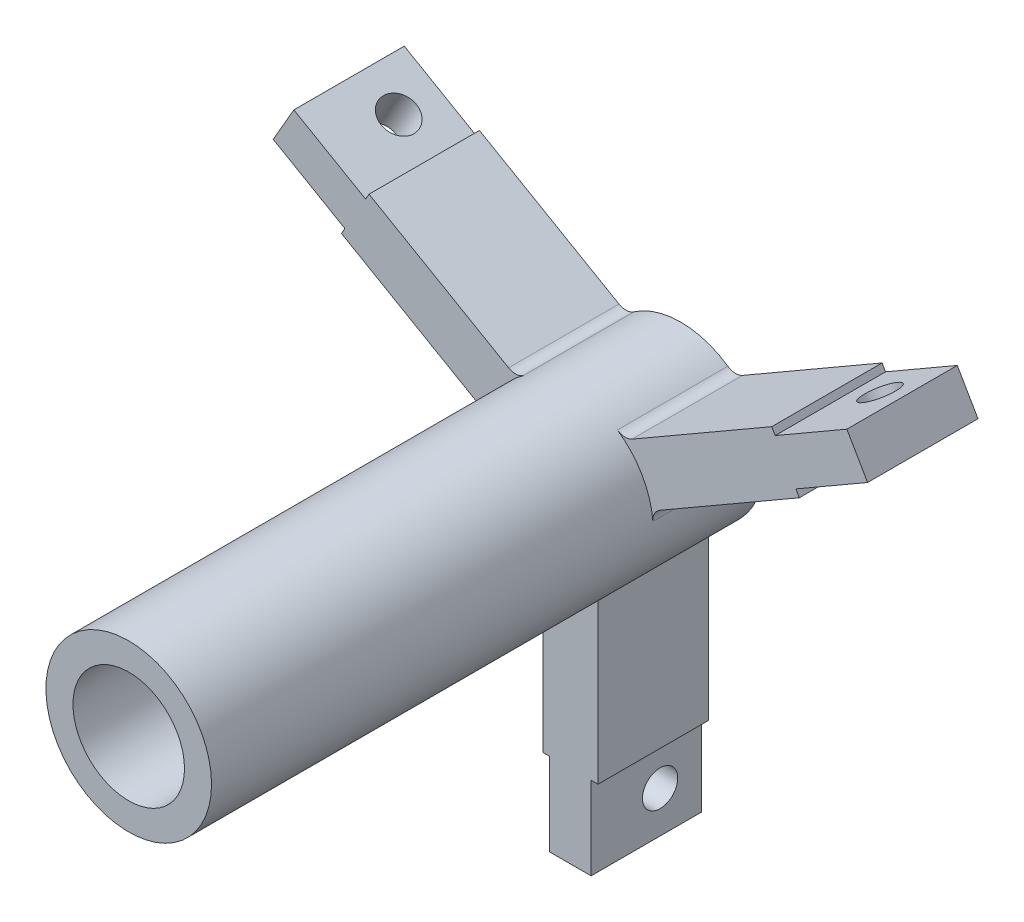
from build123d import *

# Parameters (mm, degrees)
SKETCH1_R                = 19.05
SKETCH1_R_2              = 12.827
BASE_EXTRUDE_DEPTH       = 127
BOSS_EXTRUDE1_REACH      = 161.889
BOSS_EXTRUDE1_END_RADIUS = 19.05
SKETCH2_W                = 9.525
SKETCH2_H                = 25.4
SKETCH3_R                = 4.064
CUT_EXTRUDE1_DEPTH       = 151.008250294
CIRPATTERN1_COUNT        = 3
SKETCH6_R                = 4.064
CUT_EXTRUDE2_DEPTH       = 168.917059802
SKETCH7_R                = 4.064
CUT_EXTRUDE3_DEPTH       = 158.267243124
SKETCH10_R               = 7.1501
CUT_EXTRUDE4_DEPTH       = 0.635
BOSS_EXTRUDE3_REACH      = 177.154
BOSS_EXTRUDE3_END_RADIUS = 19.05
SKETCH13_W               = 12.7
SKETCH13_H               = 25.4
CIRPATTERN2_COUNT        = 3
FILLET1_R                = 3.175
FILLET2_R                = 3.175
FILLET3_R                = 3.175


with BuildPart() as part:
    # Sketch1 → Base-Extrude (new body)
    with BuildSketch(Plane.XY):
        Circle(SKETCH1_R)
        Circle(SKETCH1_R_2, mode=Mode.SUBTRACT)
    extrude(amount=BASE_EXTRUDE_DEPTH)

    # Boss-Extrude1: up to this cylinder (the profile starts outside it)
    boss_extrude1_end = Plane(origin=(0, 0, 12.7), z_dir=(0, 0, -1)) * Cylinder(BOSS_EXTRUDE1_END_RADIUS, 362.878, mode=Mode.PRIVATE)
    # Sketch2 → Boss-Extrude1 (add, up to the surface)
    with BuildSketch(Plane(origin=(0, -76.2, 0), x_dir=(-1, 0, 0), z_dir=(0, 1, 0)), mode=Mode.PRIVATE) as boss_extrude1_sk1:
        with Locations((0, 12.7)):
            Rectangle(SKETCH2_W, SKETCH2_H)
    boss_extrude1_tool1 = extrude(boss_extrude1_sk1.sketch, amount=BOSS_EXTRUDE1_REACH, mode=Mode.PRIVATE) - boss_extrude1_end
    boss_extrude1 = boss_extrude1_tool1.solids().sort_by_distance((0, -76.2, 12.7))[0]
    add(boss_extrude1)

    # Sketch3 → Cut-Extrude1 (cut, through all)
    with BuildSketch(Plane.ZY.offset(4.7625)):
        with Locations((9.525, -66.675)):
            Circle(SKETCH3_R)
    extrude(amount=-CUT_EXTRUDE1_DEPTH, mode=Mode.SUBTRACT)

    # CirPattern1: Boss-Extrude1 ×3 about axis
    cirpattern1_axis = Axis((0, 0, 0), (0, 0, 1))
    for i in range(1, CIRPATTERN1_COUNT):
        add(boss_extrude1.rotate(cirpattern1_axis, i * 360 / CIRPATTERN1_COUNT))

    # Sketch6 → Cut-Extrude2 (cut, through all)
    with BuildSketch(Plane(origin=(-45.618861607, 20.838800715, 50.936831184), x_dir=(0.8660254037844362, -0.5000000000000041, 0), z_dir=(-0.5000000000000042, -0.8660254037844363, 0))):
        with Locations((-16.748506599, -41.411831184)):
            Circle(SKETCH6_R)
    extrude(amount=-CUT_EXTRUDE2_DEPTH, mode=Mode.SUBTRACT)

    # Sketch7 → Cut-Extrude3 (cut, through all)
    with BuildSketch(Plane(origin=(34.377585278, 14.3486468, 49.693003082), x_dir=(0.8660254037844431, 0.4999999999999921, 0), z_dir=(0.4999999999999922, -0.8660254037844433, 0))):
        with Locations((29.728814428, -40.168003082)):
            Circle(SKETCH7_R)
    extrude(amount=-CUT_EXTRUDE3_DEPTH, mode=Mode.SUBTRACT)

    # Sketch10 → Cut-Extrude4 (cut)
    with BuildSketch(Plane(origin=(0, 15.875, 0), x_dir=(-1, 0, 0), z_dir=(0, 1, 0))):
        with Locations(Location((0, 38.1, 0), (0, 0, 90))):
            Circle(SKETCH10_R)
    extrude(amount=-CUT_EXTRUDE4_DEPTH, mode=Mode.SUBTRACT)

    # Sketch12 → Hole2 (revolve, cut)
    with BuildSketch(Plane(origin=(0, 15.24, 38.1), x_dir=(0, 0, 1), z_dir=(1, 0, 0))):
        Polygon((0, 0), (0, 14.233804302), (2.552697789, 12.699989), (2.552697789, 9.52499175), (3.17499725, 9.52499175), (3.17499725, 0.002539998), (3.17499725, 0), align=None)
    revolve(axis=Axis((0, 15.24, 38.1), (0, -1, 0)), mode=Mode.SUBTRACT)

    # Boss-Extrude3: up to this cylinder (the profile starts outside it)
    boss_extrude3_end = Plane(origin=(0, 0, 12.7), z_dir=(0, 0, -1)) * Cylinder(BOSS_EXTRUDE3_END_RADIUS, 393.408, mode=Mode.PRIVATE)
    # Sketch13 → Boss-Extrude3 (add, up to the surface)
    with BuildSketch(Plane(origin=(0, -57.15, 0), x_dir=(-1, 0, 0), z_dir=(0, 1, 0)), mode=Mode.PRIVATE) as boss_extrude3_sk1:
        with Locations((0, 12.7)):
            Rectangle(SKETCH13_W, SKETCH13_H)
    boss_extrude3_tool1 = extrude(boss_extrude3_sk1.sketch, amount=BOSS_EXTRUDE3_REACH, mode=Mode.PRIVATE) - boss_extrude3_end
    boss_extrude3 = boss_extrude3_tool1.solids().sort_by_distance((0, -57.15, 12.7))[0]
    add(boss_extrude3)

    # CirPattern2: Boss-Extrude3 ×3 about axis
    cirpattern2_axis = Axis((0, 0, 0), (0, 0, 1))
    for i in range(1, CIRPATTERN2_COUNT):
        add(boss_extrude3.rotate(cirpattern2_axis, i * 360 / CIRPATTERN2_COUNT))

    # Fillet1
    fillet1_edges = [part.edges().sort_by_distance(p)[0] for p in [
        (-12.379259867, 14.479517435, 12.7),
        (12.379259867, 14.479517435, 12.7),
    ]]
    fillet(fillet1_edges, radius=FILLET1_R)

    # Fillet2
    fillet2_edges = [part.edges().sort_by_distance(p)[0] for p in [
        (-18.729259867, 3.480994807, 12.7),
        (-6.35, -17.960512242, 12.7),
    ]]
    fillet(fillet2_edges, radius=FILLET2_R)

    # Fillet3
    fillet3_edges = [part.edges().sort_by_distance(p)[0] for p in [
        (18.729259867, 3.480994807, 12.7),
        (6.35, -17.960512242, 12.7),
    ]]
    fillet(fillet3_edges, radius=FILLET3_R)


solid = part.part
